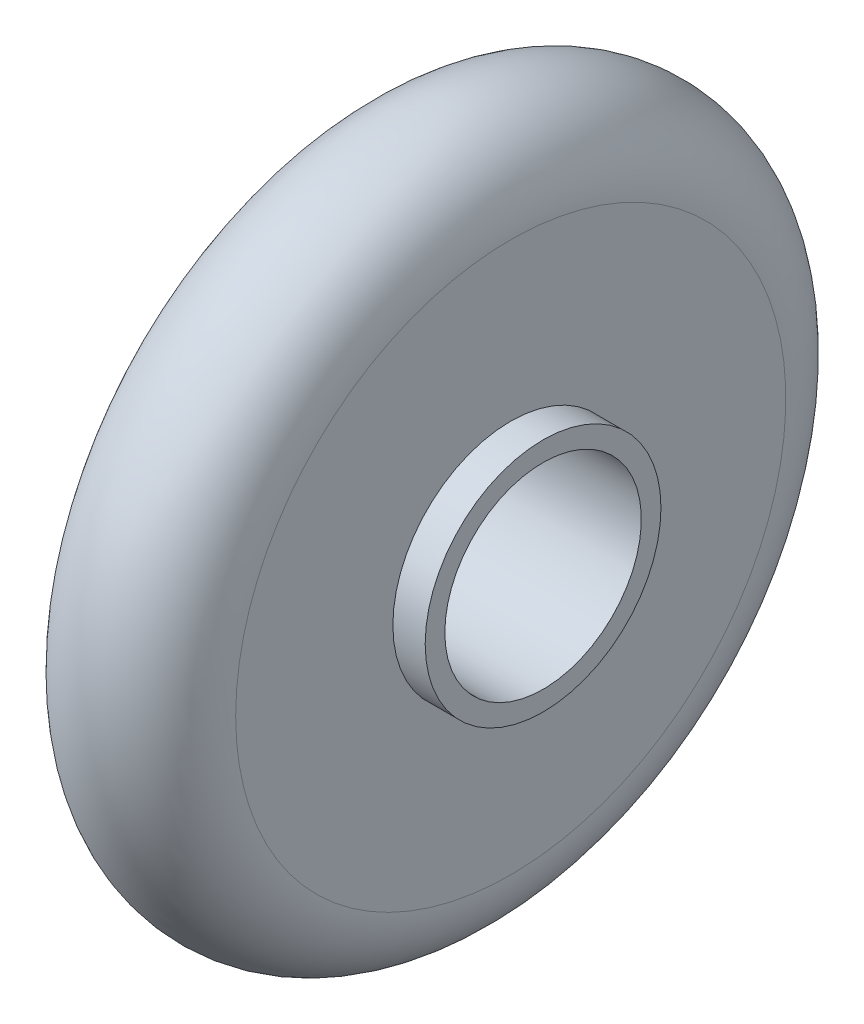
ISO-10303-21;
HEADER;
FILE_DESCRIPTION(('STEP AP214'),'2;1');
FILE_NAME('part.step','',(''),(''),'','','');
FILE_SCHEMA(('AUTOMOTIVE_DESIGN { 1 0 10303 214 1 1 1 1 }'));
ENDSEC;
DATA;
#1=APPLICATION_CONTEXT('core data for automotive mechanical design processes');
#2=APPLICATION_PROTOCOL_DEFINITION('international standard','automotive_design',2000,#1);
#3=PRODUCT_CONTEXT('',#1,'mechanical');
#4=PRODUCT('Part','Part','',(#3));
#5=PRODUCT_RELATED_PRODUCT_CATEGORY('part','',(#4));
#6=PRODUCT_DEFINITION_FORMATION('','',#4);
#7=PRODUCT_DEFINITION_CONTEXT('part definition',#1,'design');
#8=PRODUCT_DEFINITION('design','',#6,#7);
#9=PRODUCT_DEFINITION_SHAPE('','',#8);
#10=(LENGTH_UNIT() NAMED_UNIT(*) SI_UNIT(.MILLI.,.METRE.));
#11=(NAMED_UNIT(*) PLANE_ANGLE_UNIT() SI_UNIT($,.RADIAN.));
#12=(NAMED_UNIT(*) SI_UNIT($,.STERADIAN.) SOLID_ANGLE_UNIT());
#13=UNCERTAINTY_MEASURE_WITH_UNIT(LENGTH_MEASURE(1.E-05),#10,'distance_accuracy_value','');
#14=(GEOMETRIC_REPRESENTATION_CONTEXT(3) GLOBAL_UNCERTAINTY_ASSIGNED_CONTEXT((#13)) GLOBAL_UNIT_ASSIGNED_CONTEXT((#10,
#11,#12)) REPRESENTATION_CONTEXT('',''));
#15=CARTESIAN_POINT('',(0.,0.,0.));
#16=DIRECTION('',(0.,0.,1.));
#17=DIRECTION('',(1.,0.,0.));
#18=AXIS2_PLACEMENT_3D('',#15,#16,#17);
#19=CARTESIAN_POINT('',(-56.355,-4.,0.));
#20=DIRECTION('',(-1.,0.,0.));
#21=DIRECTION('',(0.,0.,1.));
#22=AXIS2_PLACEMENT_3D('',#19,#20,#21);
#23=TOROIDAL_SURFACE('',#22,14.,4.);
#24=CARTESIAN_POINT('',(-60.355,-4.,0.));
#25=DIRECTION('',(-1.,0.,0.));
#26=DIRECTION('',(0.,0.,1.));
#27=AXIS2_PLACEMENT_3D('',#24,#25,#26);
#28=CIRCLE('',#27,14.);
#29=CARTESIAN_POINT('',(-60.355,-4.,14.));
#30=VERTEX_POINT('',#29);
#31=EDGE_CURVE('E55',#30,#30,#28,.T.);
#32=ORIENTED_EDGE('',*,*,#31,.F.);
#33=EDGE_LOOP('',(#32));
#34=FACE_BOUND('',#33,.T.);
#35=CARTESIAN_POINT('',(-52.355,-4.,0.));
#36=DIRECTION('',(-1.,0.,0.));
#37=DIRECTION('',(0.,0.,1.));
#38=AXIS2_PLACEMENT_3D('',#35,#36,#37);
#39=CIRCLE('',#38,14.);
#40=CARTESIAN_POINT('',(-52.355,-4.,14.));
#41=VERTEX_POINT('',#40);
#42=EDGE_CURVE('E10',#41,#41,#39,.T.);
#43=ORIENTED_EDGE('',*,*,#42,.T.);
#44=EDGE_LOOP('',(#43));
#45=FACE_BOUND('',#44,.T.);
#46=ADVANCED_FACE('F27',(#34,#45),#23,.T.);
#47=CARTESIAN_POINT('',(-52.355,10.,0.));
#48=DIRECTION('',(-1.,0.,0.));
#49=DIRECTION('',(0.,0.,1.));
#50=AXIS2_PLACEMENT_3D('',#47,#48,#49);
#51=PLANE('',#50);
#52=ORIENTED_EDGE('',*,*,#42,.F.);
#53=EDGE_LOOP('',(#52));
#54=FACE_BOUND('',#53,.T.);
#55=CARTESIAN_POINT('',(-52.355,-4.,0.));
#56=DIRECTION('',(-1.,0.,0.));
#57=DIRECTION('',(0.,0.,1.));
#58=AXIS2_PLACEMENT_3D('',#55,#56,#57);
#59=CIRCLE('',#58,6.);
#60=CARTESIAN_POINT('',(-52.355,-4.,6.));
#61=VERTEX_POINT('',#60);
#62=EDGE_CURVE('E33',#61,#61,#59,.T.);
#63=ORIENTED_EDGE('',*,*,#62,.T.);
#64=EDGE_LOOP('',(#63));
#65=FACE_BOUND('',#64,.T.);
#66=ADVANCED_FACE('F62',(#54,#65),#51,.F.);
#67=CARTESIAN_POINT('',(-66.,-4.,0.));
#68=DIRECTION('',(-1.,0.,0.));
#69=DIRECTION('',(0.,0.,1.));
#70=AXIS2_PLACEMENT_3D('',#67,#68,#69);
#71=CYLINDRICAL_SURFACE('',#70,6.);
#72=ORIENTED_EDGE('',*,*,#62,.F.);
#73=EDGE_LOOP('',(#72));
#74=FACE_BOUND('',#73,.T.);
#75=CARTESIAN_POINT('',(-50.71,-4.,0.));
#76=DIRECTION('',(-1.,0.,0.));
#77=DIRECTION('',(0.,0.,1.));
#78=AXIS2_PLACEMENT_3D('',#75,#76,#77);
#79=CIRCLE('',#78,6.);
#80=CARTESIAN_POINT('',(-50.71,-4.,6.));
#81=VERTEX_POINT('',#80);
#82=EDGE_CURVE('E37',#81,#81,#79,.T.);
#83=ORIENTED_EDGE('',*,*,#82,.T.);
#84=EDGE_LOOP('',(#83));
#85=FACE_BOUND('',#84,.T.);
#86=ADVANCED_FACE('F66',(#74,#85),#71,.T.);
#87=CARTESIAN_POINT('',(-50.71,1.,0.));
#88=DIRECTION('',(-1.,0.,0.));
#89=DIRECTION('',(0.,0.,1.));
#90=AXIS2_PLACEMENT_3D('',#87,#88,#89);
#91=PLANE('',#90);
#92=ORIENTED_EDGE('',*,*,#82,.F.);
#93=EDGE_LOOP('',(#92));
#94=FACE_BOUND('',#93,.T.);
#95=CARTESIAN_POINT('',(-50.71,-4.,0.));
#96=DIRECTION('',(-1.,0.,0.));
#97=DIRECTION('',(0.,0.,1.));
#98=AXIS2_PLACEMENT_3D('',#95,#96,#97);
#99=CIRCLE('',#98,5.);
#100=CARTESIAN_POINT('',(-50.71,-4.,5.));
#101=VERTEX_POINT('',#100);
#102=EDGE_CURVE('E41',#101,#101,#99,.T.);
#103=ORIENTED_EDGE('',*,*,#102,.T.);
#104=EDGE_LOOP('',(#103));
#105=FACE_BOUND('',#104,.T.);
#106=ADVANCED_FACE('F71',(#94,#105),#91,.F.);
#107=CARTESIAN_POINT('',(-66.,-4.,0.));
#108=DIRECTION('',(-1.,0.,0.));
#109=DIRECTION('',(0.,0.,1.));
#110=AXIS2_PLACEMENT_3D('',#107,#108,#109);
#111=CYLINDRICAL_SURFACE('',#110,5.);
#112=ORIENTED_EDGE('',*,*,#102,.F.);
#113=EDGE_LOOP('',(#112));
#114=FACE_BOUND('',#113,.T.);
#115=CARTESIAN_POINT('',(-62.,-4.,0.));
#116=DIRECTION('',(-1.,0.,0.));
#117=DIRECTION('',(0.,0.,1.));
#118=AXIS2_PLACEMENT_3D('',#115,#116,#117);
#119=CIRCLE('',#118,5.);
#120=CARTESIAN_POINT('',(-62.,-4.,5.));
#121=VERTEX_POINT('',#120);
#122=EDGE_CURVE('E46',#121,#121,#119,.T.);
#123=ORIENTED_EDGE('',*,*,#122,.T.);
#124=EDGE_LOOP('',(#123));
#125=FACE_BOUND('',#124,.T.);
#126=ADVANCED_FACE('F77',(#114,#125),#111,.F.);
#127=CARTESIAN_POINT('',(-62.,1.,0.));
#128=DIRECTION('',(1.,0.,0.));
#129=DIRECTION('',(0.,0.,-1.));
#130=AXIS2_PLACEMENT_3D('',#127,#128,#129);
#131=PLANE('',#130);
#132=ORIENTED_EDGE('',*,*,#122,.F.);
#133=EDGE_LOOP('',(#132));
#134=FACE_BOUND('',#133,.T.);
#135=CARTESIAN_POINT('',(-62.,-4.,0.));
#136=DIRECTION('',(-1.,0.,0.));
#137=DIRECTION('',(0.,0.,1.));
#138=AXIS2_PLACEMENT_3D('',#135,#136,#137);
#139=CIRCLE('',#138,6.);
#140=CARTESIAN_POINT('',(-62.,-4.,6.));
#141=VERTEX_POINT('',#140);
#142=EDGE_CURVE('E49',#141,#141,#139,.T.);
#143=ORIENTED_EDGE('',*,*,#142,.T.);
#144=EDGE_LOOP('',(#143));
#145=FACE_BOUND('',#144,.T.);
#146=ADVANCED_FACE('F81',(#134,#145),#131,.F.);
#147=CARTESIAN_POINT('',(-66.,-4.,0.));
#148=DIRECTION('',(-1.,0.,0.));
#149=DIRECTION('',(0.,0.,1.));
#150=AXIS2_PLACEMENT_3D('',#147,#148,#149);
#151=CYLINDRICAL_SURFACE('',#150,6.);
#152=ORIENTED_EDGE('',*,*,#142,.F.);
#153=EDGE_LOOP('',(#152));
#154=FACE_BOUND('',#153,.T.);
#155=CARTESIAN_POINT('',(-60.355,-4.,0.));
#156=DIRECTION('',(-1.,0.,0.));
#157=DIRECTION('',(0.,0.,1.));
#158=AXIS2_PLACEMENT_3D('',#155,#156,#157);
#159=CIRCLE('',#158,6.);
#160=CARTESIAN_POINT('',(-60.355,-4.,6.));
#161=VERTEX_POINT('',#160);
#162=EDGE_CURVE('E52',#161,#161,#159,.T.);
#163=ORIENTED_EDGE('',*,*,#162,.T.);
#164=EDGE_LOOP('',(#163));
#165=FACE_BOUND('',#164,.T.);
#166=ADVANCED_FACE('F85',(#154,#165),#151,.T.);
#167=CARTESIAN_POINT('',(-60.355,10.,0.));
#168=DIRECTION('',(1.,0.,0.));
#169=DIRECTION('',(0.,0.,-1.));
#170=AXIS2_PLACEMENT_3D('',#167,#168,#169);
#171=PLANE('',#170);
#172=ORIENTED_EDGE('',*,*,#162,.F.);
#173=EDGE_LOOP('',(#172));
#174=FACE_BOUND('',#173,.T.);
#175=ORIENTED_EDGE('',*,*,#31,.T.);
#176=EDGE_LOOP('',(#175));
#177=FACE_BOUND('',#176,.T.);
#178=ADVANCED_FACE('F59',(#174,#177),#171,.F.);
#179=CLOSED_SHELL('',(#46,#66,#86,#106,#126,#146,#166,#178));
#180=MANIFOLD_SOLID_BREP('B2',#179);
#181=ADVANCED_BREP_SHAPE_REPRESENTATION('',(#18,#180),#14);
#182=SHAPE_DEFINITION_REPRESENTATION(#9,#181);
ENDSEC;
END-ISO-10303-21;
